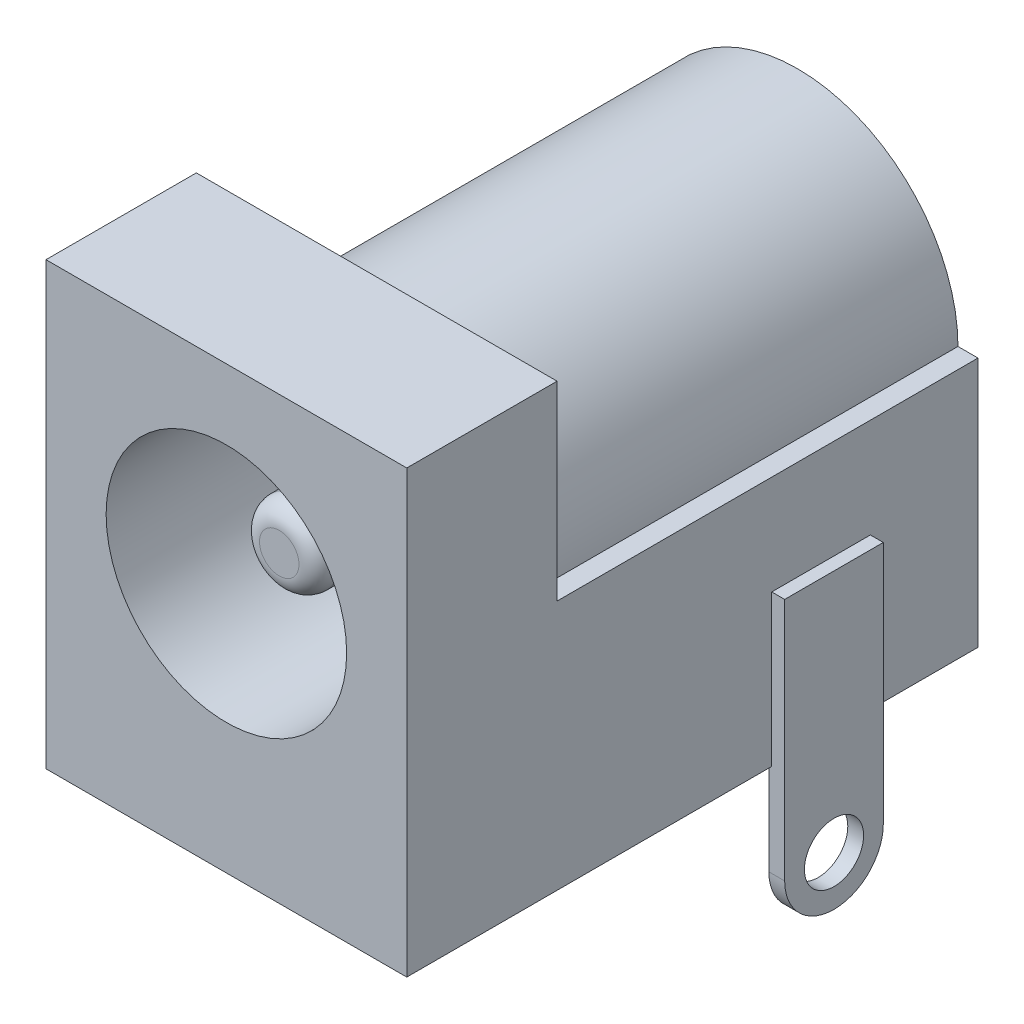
from build123d import *

# Parameters (mm, degrees)
SKETCH1_W           = 9.144
SKETCH1_H           = 11.176
BASE_EXTRUDE_DEPTH  = 3.81
BOSS_EXTRUDE1_DEPTH = 10.668
SKETCH3_R           = 3.048
CUT_EXTRUDE1_DEPTH  = 9.144
SKETCH4_R           = 1
EXTRUDE1_DEPTH      = 7.804
FILLET1_R           = 0.5
SKETCH5_R           = 0.75
EXTRUDE2_DEPTH      = 0.2
SKETCH6_R           = 0.75
EXTRUDE3_DEPTH      = 0.15
SKETCH7_R           = 0.75
EXTRUDE4_DEPTH      = 0.2


with BuildPart() as part:
    # Sketch1 → Base-Extrude (new body)
    with BuildSketch(Plane.XY):
        with Locations((0, 5.588)):
            Rectangle(SKETCH1_W, SKETCH1_H)
    extrude(amount=-BASE_EXTRUDE_DEPTH)

    # Sketch2 → Boss-Extrude1 (add)
    with BuildSketch(Plane(origin=(0, 0, -3.81), x_dir=(-1, 0, 0), z_dir=(0, 0, -1))):
        with BuildLine():
            Line((-4.572, 0), (-4.572, 6.35))
            Line((-4.572, 6.35), (-4.064, 6.35))
            ThreePointArc((-4.064, 6.35), (0, 10.414), (4.064, 6.35))
            Line((4.064, 6.35), (4.572, 6.35))
            Line((4.572, 6.35), (4.572, 0))
            Line((4.572, 0), (-4.572, 0))
        make_face()
    extrude(amount=BOSS_EXTRUDE1_DEPTH)

    # Sketch3 → Cut-Extrude1 (cut)
    with BuildSketch(Plane.XY):
        with Locations((0, 6.35)):
            Circle(SKETCH3_R)
    extrude(amount=-CUT_EXTRUDE1_DEPTH, mode=Mode.SUBTRACT)

    # Sketch4 → Extrude1 (add)
    with BuildSketch(Plane.XY.offset(-9.144)):
        with Locations(Location((0, 6.35, 0), (0, 0, 180))):
            Circle(SKETCH4_R)
    extrude(amount=EXTRUDE1_DEPTH)

    # Fillet1
    fillet1_edges = [part.edges().sort_by_distance(p)[0] for p in [
        (1, 6.35, -1.34),
    ]]
    fillet(fillet1_edges, radius=FILLET1_R)

    # Sketch5 → Extrude2 (add, symmetric)
    with BuildSketch(Plane(origin=(4.7, 0, 0), x_dir=(0, 0, -1), z_dir=(1, 0, 0))):
        with BuildLine():
            Line((11.75, 3.83), (11.75, -2.35))
            ThreePointArc((11.75, -2.35), (10.5, -3.6), (9.25, -2.35))
            Line((9.25, -2.35), (9.25, 3.83))
            Line((9.25, 3.83), (11.75, 3.83))
        make_face()
        with Locations((10.5, -2.35)):
            Circle(SKETCH5_R, mode=Mode.SUBTRACT)
    extrude(amount=EXTRUDE2_DEPTH, both=True)

    # Sketch6 → Extrude3 (add, symmetric)
    with BuildSketch(Plane(origin=(0, 0, -7.5), x_dir=(-1, 0, 0), z_dir=(0, 0, 1))):
        with BuildLine():
            Line((-1.1, 0), (-1.1, 2.5))
            ThreePointArc((-1.1, 2.5), (0, 3.6), (1.1, 2.5))
            Line((1.1, 2.5), (1.1, 0))
            Line((1.1, 0), (-1.1, 0))
        make_face()
        with Locations(Location((0, 2.5, 0), (0, 0, 180))):
            Circle(SKETCH6_R, mode=Mode.SUBTRACT)
    extrude(amount=EXTRUDE3_DEPTH, both=True)

    # Sketch7 → Extrude4 (add, symmetric)
    with BuildSketch(Plane.XY.offset(-13.7)):
        with BuildLine():
            Line((1.425, 0), (1.425, -2.175))
            ThreePointArc((1.425, -2.175), (0, -3.6), (-1.425, -2.175))
            Line((-1.425, -2.175), (-1.425, 0))
            Line((-1.425, 0), (1.425, 0))
        make_face()
        with Locations((0, -2.175)):
            Circle(SKETCH7_R, mode=Mode.SUBTRACT)
    extrude(amount=EXTRUDE4_DEPTH, both=True)


solid = part.part
